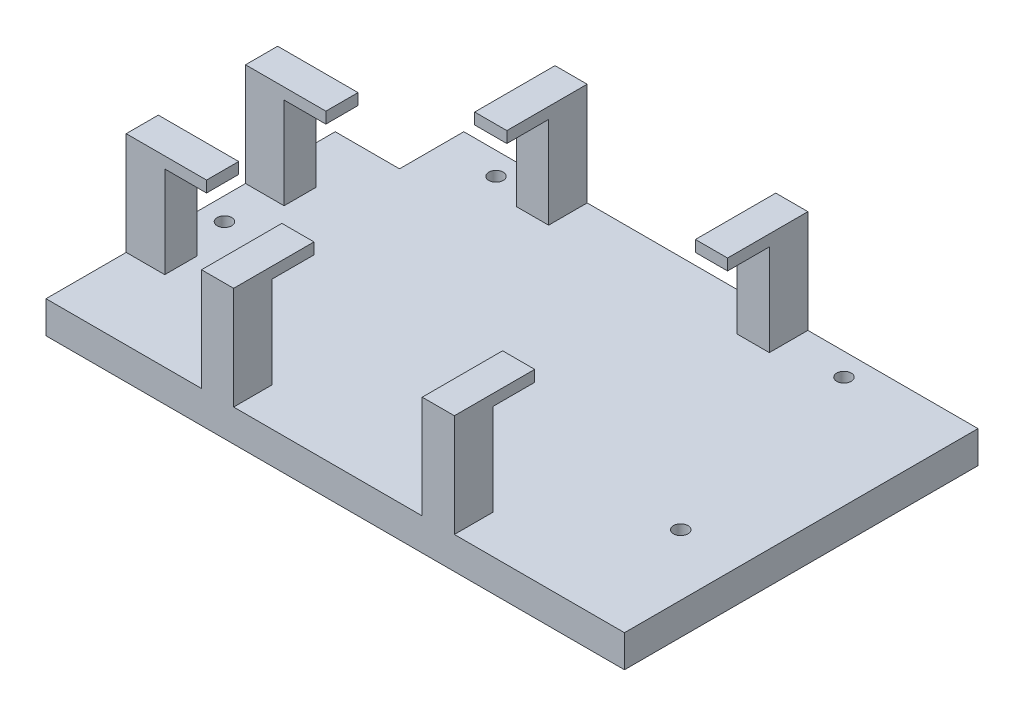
ISO-10303-21;
HEADER;
FILE_DESCRIPTION(('STEP AP214'),'2;1');
FILE_NAME('part.step','',(''),(''),'','','');
FILE_SCHEMA(('AUTOMOTIVE_DESIGN { 1 0 10303 214 1 1 1 1 }'));
ENDSEC;
DATA;
#1=APPLICATION_CONTEXT('core data for automotive mechanical design processes');
#2=APPLICATION_PROTOCOL_DEFINITION('international standard','automotive_design',2000,#1);
#3=PRODUCT_CONTEXT('',#1,'mechanical');
#4=PRODUCT('Part','Part','',(#3));
#5=PRODUCT_RELATED_PRODUCT_CATEGORY('part','',(#4));
#6=PRODUCT_DEFINITION_FORMATION('','',#4);
#7=PRODUCT_DEFINITION_CONTEXT('part definition',#1,'design');
#8=PRODUCT_DEFINITION('design','',#6,#7);
#9=PRODUCT_DEFINITION_SHAPE('','',#8);
#10=(LENGTH_UNIT() NAMED_UNIT(*) SI_UNIT(.MILLI.,.METRE.));
#11=(NAMED_UNIT(*) PLANE_ANGLE_UNIT() SI_UNIT($,.RADIAN.));
#12=(NAMED_UNIT(*) SI_UNIT($,.STERADIAN.) SOLID_ANGLE_UNIT());
#13=UNCERTAINTY_MEASURE_WITH_UNIT(LENGTH_MEASURE(1.E-05),#10,'distance_accuracy_value','');
#14=(GEOMETRIC_REPRESENTATION_CONTEXT(3) GLOBAL_UNCERTAINTY_ASSIGNED_CONTEXT((#13)) GLOBAL_UNIT_ASSIGNED_CONTEXT((#10,
#11,#12)) REPRESENTATION_CONTEXT('',''));
#15=CARTESIAN_POINT('',(0.,0.,0.));
#16=DIRECTION('',(0.,0.,1.));
#17=DIRECTION('',(1.,0.,0.));
#18=AXIS2_PLACEMENT_3D('',#15,#16,#17);
#19=CARTESIAN_POINT('',(0.,0.,0.));
#20=DIRECTION('',(0.,1.,0.));
#21=DIRECTION('',(0.,0.,1.));
#22=AXIS2_PLACEMENT_3D('',#19,#20,#21);
#23=PLANE('',#22);
#24=CARTESIAN_POINT('',(161.,0.,73.5));
#25=DIRECTION('',(0.,1.,0.));
#26=DIRECTION('',(0.,0.,1.));
#27=AXIS2_PLACEMENT_3D('',#24,#25,#26);
#28=CIRCLE('',#27,2.25000000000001);
#29=CARTESIAN_POINT('',(161.,0.,75.75));
#30=VERTEX_POINT('',#29);
#31=EDGE_CURVE('E641',#30,#30,#28,.T.);
#32=ORIENTED_EDGE('',*,*,#31,.F.);
#33=EDGE_LOOP('',(#32));
#34=FACE_BOUND('',#33,.T.);
#35=CARTESIAN_POINT('',(7.00000000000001,0.,61.4747149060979));
#36=DIRECTION('',(0.,1.,0.));
#37=DIRECTION('',(0.,0.,1.));
#38=AXIS2_PLACEMENT_3D('',#35,#36,#37);
#39=CIRCLE('',#38,2.24999999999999);
#40=CARTESIAN_POINT('',(7.00000000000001,0.,63.7247149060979));
#41=VERTEX_POINT('',#40);
#42=EDGE_CURVE('E635',#41,#41,#39,.T.);
#43=ORIENTED_EDGE('',*,*,#42,.F.);
#44=EDGE_LOOP('',(#43));
#45=FACE_BOUND('',#44,.T.);
#46=CARTESIAN_POINT('',(145.292136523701,0.,6.99999999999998));
#47=DIRECTION('',(0.,1.,0.));
#48=DIRECTION('',(0.,0.,1.));
#49=AXIS2_PLACEMENT_3D('',#46,#47,#48);
#50=CIRCLE('',#49,2.25000000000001);
#51=CARTESIAN_POINT('',(145.292136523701,0.,9.24999999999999));
#52=VERTEX_POINT('',#51);
#53=EDGE_CURVE('E617',#52,#52,#50,.T.);
#54=ORIENTED_EDGE('',*,*,#53,.F.);
#55=EDGE_LOOP('',(#54));
#56=FACE_BOUND('',#55,.T.);
#57=CARTESIAN_POINT('',(37.0246117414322,0.,6.99999999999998));
#58=DIRECTION('',(0.,1.,0.));
#59=DIRECTION('',(0.,0.,1.));
#60=AXIS2_PLACEMENT_3D('',#57,#58,#59);
#61=CIRCLE('',#60,2.25);
#62=CARTESIAN_POINT('',(37.0246117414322,0.,9.24999999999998));
#63=VERTEX_POINT('',#62);
#64=EDGE_CURVE('E625',#63,#63,#61,.T.);
#65=ORIENTED_EDGE('',*,*,#64,.F.);
#66=EDGE_LOOP('',(#65));
#67=FACE_BOUND('',#66,.T.);
#68=DIRECTION('',(1.,0.,0.));
#69=VECTOR('',#68,1.);
#70=CARTESIAN_POINT('',(0.,0.,110.));
#71=LINE('',#70,#69);
#72=CARTESIAN_POINT('',(58.3906525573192,0.,110.));
#73=VERTEX_POINT('',#72);
#74=CARTESIAN_POINT('',(117.070420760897,0.,110.));
#75=VERTEX_POINT('',#74);
#76=EDGE_CURVE('E672',#73,#75,#71,.T.);
#77=ORIENTED_EDGE('',*,*,#76,.T.);
#78=DIRECTION('',(0.,0.,1.));
#79=VECTOR('',#78,1.);
#80=CARTESIAN_POINT('',(117.070420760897,0.,110.));
#81=LINE('',#80,#79);
#82=CARTESIAN_POINT('',(117.070420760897,0.,98.));
#83=VERTEX_POINT('',#82);
#84=EDGE_CURVE('E61',#83,#75,#81,.T.);
#85=ORIENTED_EDGE('',*,*,#84,.F.);
#86=DIRECTION('',(-1.,0.,0.));
#87=VECTOR('',#86,1.);
#88=CARTESIAN_POINT('',(117.070420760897,0.,98.));
#89=LINE('',#88,#87);
#90=CARTESIAN_POINT('',(127.070420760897,0.,98.));
#91=VERTEX_POINT('',#90);
#92=EDGE_CURVE('E56',#91,#83,#89,.T.);
#93=ORIENTED_EDGE('',*,*,#92,.F.);
#94=DIRECTION('',(0.,0.,-1.));
#95=VECTOR('',#94,1.);
#96=CARTESIAN_POINT('',(127.070420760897,0.,110.));
#97=LINE('',#96,#95);
#98=CARTESIAN_POINT('',(127.070420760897,0.,110.));
#99=VERTEX_POINT('',#98);
#100=EDGE_CURVE('E496',#99,#91,#97,.T.);
#101=ORIENTED_EDGE('',*,*,#100,.F.);
#102=CARTESIAN_POINT('',(180.,0.,110.));
#103=VERTEX_POINT('',#102);
#104=EDGE_CURVE('E667',#99,#103,#71,.T.);
#105=ORIENTED_EDGE('',*,*,#104,.T.);
#106=DIRECTION('',(0.,0.,1.));
#107=VECTOR('',#106,1.);
#108=CARTESIAN_POINT('',(180.,0.,0.));
#109=LINE('',#108,#107);
#110=CARTESIAN_POINT('',(180.,0.,0.));
#111=VERTEX_POINT('',#110);
#112=EDGE_CURVE('E671',#111,#103,#109,.T.);
#113=ORIENTED_EDGE('',*,*,#112,.F.);
#114=DIRECTION('',(-1.,0.,0.));
#115=VECTOR('',#114,1.);
#116=CARTESIAN_POINT('',(0.,0.,0.));
#117=LINE('',#116,#115);
#118=CARTESIAN_POINT('',(127.070420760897,0.,0.));
#119=VERTEX_POINT('',#118);
#120=EDGE_CURVE('E656',#111,#119,#117,.T.);
#121=ORIENTED_EDGE('',*,*,#120,.T.);
#122=DIRECTION('',(0.,0.,-1.));
#123=VECTOR('',#122,1.);
#124=CARTESIAN_POINT('',(127.070420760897,0.,0.));
#125=LINE('',#124,#123);
#126=CARTESIAN_POINT('',(127.070420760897,0.,12.));
#127=VERTEX_POINT('',#126);
#128=EDGE_CURVE('E538',#127,#119,#125,.T.);
#129=ORIENTED_EDGE('',*,*,#128,.F.);
#130=DIRECTION('',(1.,0.,0.));
#131=VECTOR('',#130,1.);
#132=CARTESIAN_POINT('',(117.070420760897,0.,12.));
#133=LINE('',#132,#131);
#134=CARTESIAN_POINT('',(117.070420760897,0.,12.));
#135=VERTEX_POINT('',#134);
#136=EDGE_CURVE('E541',#135,#127,#133,.T.);
#137=ORIENTED_EDGE('',*,*,#136,.F.);
#138=DIRECTION('',(0.,0.,1.));
#139=VECTOR('',#138,1.);
#140=CARTESIAN_POINT('',(117.070420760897,0.,0.));
#141=LINE('',#140,#139);
#142=CARTESIAN_POINT('',(117.070420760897,0.,0.));
#143=VERTEX_POINT('',#142);
#144=EDGE_CURVE('E544',#143,#135,#141,.T.);
#145=ORIENTED_EDGE('',*,*,#144,.F.);
#146=CARTESIAN_POINT('',(58.3906525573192,0.,0.));
#147=VERTEX_POINT('',#146);
#148=EDGE_CURVE('E676',#143,#147,#117,.T.);
#149=ORIENTED_EDGE('',*,*,#148,.T.);
#150=DIRECTION('',(0.,0.,-1.));
#151=VECTOR('',#150,1.);
#152=CARTESIAN_POINT('',(58.3906525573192,0.,0.));
#153=LINE('',#152,#151);
#154=CARTESIAN_POINT('',(58.3906525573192,0.,12.));
#155=VERTEX_POINT('',#154);
#156=EDGE_CURVE('E315',#155,#147,#153,.T.);
#157=ORIENTED_EDGE('',*,*,#156,.F.);
#158=DIRECTION('',(1.,0.,0.));
#159=VECTOR('',#158,1.);
#160=CARTESIAN_POINT('',(48.3906525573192,0.,12.));
#161=LINE('',#160,#159);
#162=CARTESIAN_POINT('',(48.3906525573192,0.,12.));
#163=VERTEX_POINT('',#162);
#164=EDGE_CURVE('E556',#163,#155,#161,.T.);
#165=ORIENTED_EDGE('',*,*,#164,.F.);
#166=DIRECTION('',(0.,0.,1.));
#167=VECTOR('',#166,1.);
#168=CARTESIAN_POINT('',(48.3906525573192,0.,0.));
#169=LINE('',#168,#167);
#170=CARTESIAN_POINT('',(48.3906525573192,0.,0.));
#171=VERTEX_POINT('',#170);
#172=EDGE_CURVE('E559',#171,#163,#169,.T.);
#173=ORIENTED_EDGE('',*,*,#172,.F.);
#174=CARTESIAN_POINT('',(20.,0.,0.));
#175=VERTEX_POINT('',#174);
#176=EDGE_CURVE('E675',#171,#175,#117,.T.);
#177=ORIENTED_EDGE('',*,*,#176,.T.);
#178=DIRECTION('',(0.,0.,-1.));
#179=VECTOR('',#178,1.);
#180=CARTESIAN_POINT('',(20.,0.,0.));
#181=LINE('',#180,#179);
#182=CARTESIAN_POINT('',(20.,0.,20.));
#183=VERTEX_POINT('',#182);
#184=EDGE_CURVE('E618',#183,#175,#181,.T.);
#185=ORIENTED_EDGE('',*,*,#184,.F.);
#186=DIRECTION('',(1.,0.,0.));
#187=VECTOR('',#186,1.);
#188=CARTESIAN_POINT('',(0.,0.,20.));
#189=LINE('',#188,#187);
#190=CARTESIAN_POINT('',(0.,0.,20.));
#191=VERTEX_POINT('',#190);
#192=EDGE_CURVE('E621',#191,#183,#189,.T.);
#193=ORIENTED_EDGE('',*,*,#192,.F.);
#194=DIRECTION('',(0.,0.,-1.));
#195=VECTOR('',#194,1.);
#196=CARTESIAN_POINT('',(0.,0.,0.));
#197=LINE('',#196,#195);
#198=CARTESIAN_POINT('',(0.,0.,37.9161136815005));
#199=VERTEX_POINT('',#198);
#200=EDGE_CURVE('E649',#199,#191,#197,.T.);
#201=ORIENTED_EDGE('',*,*,#200,.F.);
#202=DIRECTION('',(-1.,0.,0.));
#203=VECTOR('',#202,1.);
#204=CARTESIAN_POINT('',(0.,0.,37.9161136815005));
#205=LINE('',#204,#203);
#206=CARTESIAN_POINT('',(12.,0.,37.9161136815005));
#207=VERTEX_POINT('',#206);
#208=EDGE_CURVE('E589',#207,#199,#205,.T.);
#209=ORIENTED_EDGE('',*,*,#208,.F.);
#210=DIRECTION('',(0.,0.,-1.));
#211=VECTOR('',#210,1.);
#212=CARTESIAN_POINT('',(12.,0.,37.9161136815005));
#213=LINE('',#212,#211);
#214=CARTESIAN_POINT('',(12.,0.,47.9161136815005));
#215=VERTEX_POINT('',#214);
#216=EDGE_CURVE('E592',#215,#207,#213,.T.);
#217=ORIENTED_EDGE('',*,*,#216,.F.);
#218=DIRECTION('',(1.,0.,0.));
#219=VECTOR('',#218,1.);
#220=CARTESIAN_POINT('',(0.,0.,47.9161136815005));
#221=LINE('',#220,#219);
#222=CARTESIAN_POINT('',(0.,0.,47.9161136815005));
#223=VERTEX_POINT('',#222);
#224=EDGE_CURVE('E582',#223,#215,#221,.T.);
#225=ORIENTED_EDGE('',*,*,#224,.F.);
#226=CARTESIAN_POINT('',(0.,0.,75.0482136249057));
#227=VERTEX_POINT('',#226);
#228=EDGE_CURVE('E668',#227,#223,#197,.T.);
#229=ORIENTED_EDGE('',*,*,#228,.F.);
#230=DIRECTION('',(-1.,0.,0.));
#231=VECTOR('',#230,1.);
#232=CARTESIAN_POINT('',(0.,0.,75.0482136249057));
#233=LINE('',#232,#231);
#234=CARTESIAN_POINT('',(12.,0.,75.0482136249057));
#235=VERTEX_POINT('',#234);
#236=EDGE_CURVE('E575',#235,#227,#233,.T.);
#237=ORIENTED_EDGE('',*,*,#236,.F.);
#238=DIRECTION('',(0.,0.,-1.));
#239=VECTOR('',#238,1.);
#240=CARTESIAN_POINT('',(12.,0.,75.0482136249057));
#241=LINE('',#240,#239);
#242=CARTESIAN_POINT('',(12.,0.,85.0482136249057));
#243=VERTEX_POINT('',#242);
#244=EDGE_CURVE('E577',#243,#235,#241,.T.);
#245=ORIENTED_EDGE('',*,*,#244,.F.);
#246=DIRECTION('',(1.,0.,0.));
#247=VECTOR('',#246,1.);
#248=CARTESIAN_POINT('',(0.,0.,85.0482136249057));
#249=LINE('',#248,#247);
#250=CARTESIAN_POINT('',(0.,0.,85.0482136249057));
#251=VERTEX_POINT('',#250);
#252=EDGE_CURVE('E580',#251,#243,#249,.T.);
#253=ORIENTED_EDGE('',*,*,#252,.F.);
#254=CARTESIAN_POINT('',(0.,0.,110.));
#255=VERTEX_POINT('',#254);
#256=EDGE_CURVE('E664',#255,#251,#197,.T.);
#257=ORIENTED_EDGE('',*,*,#256,.F.);
#258=CARTESIAN_POINT('',(48.3906525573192,0.,110.));
#259=VERTEX_POINT('',#258);
#260=EDGE_CURVE('E669',#255,#259,#71,.T.);
#261=ORIENTED_EDGE('',*,*,#260,.T.);
#262=DIRECTION('',(0.,0.,1.));
#263=VECTOR('',#262,1.);
#264=CARTESIAN_POINT('',(48.3906525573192,0.,110.));
#265=LINE('',#264,#263);
#266=CARTESIAN_POINT('',(48.3906525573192,0.,98.));
#267=VERTEX_POINT('',#266);
#268=EDGE_CURVE('E520',#267,#259,#265,.T.);
#269=ORIENTED_EDGE('',*,*,#268,.F.);
#270=DIRECTION('',(-1.,0.,0.));
#271=VECTOR('',#270,1.);
#272=CARTESIAN_POINT('',(48.3906525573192,0.,98.));
#273=LINE('',#272,#271);
#274=CARTESIAN_POINT('',(58.3906525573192,0.,98.));
#275=VERTEX_POINT('',#274);
#276=EDGE_CURVE('E514',#275,#267,#273,.T.);
#277=ORIENTED_EDGE('',*,*,#276,.F.);
#278=DIRECTION('',(0.,0.,-1.));
#279=VECTOR('',#278,1.);
#280=CARTESIAN_POINT('',(58.3906525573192,0.,110.));
#281=LINE('',#280,#279);
#282=EDGE_CURVE('E517',#73,#275,#281,.T.);
#283=ORIENTED_EDGE('',*,*,#282,.F.);
#284=EDGE_LOOP('',(#77,#85,#93,#101,#105,#113,#121,#129,#137,#145,#149,#157,#165,#173,#177,#185,
#193,#201,#209,#217,#225,#229,#237,#245,#253,#257,#261,#269,#277,#283));
#285=FACE_BOUND('',#284,.T.);
#286=ADVANCED_FACE('F39',(#34,#45,#56,#67,#285),#23,.T.);
#287=CARTESIAN_POINT('',(0.,-10.,0.));
#288=DIRECTION('',(1.,0.,0.));
#289=DIRECTION('',(0.,0.,-1.));
#290=AXIS2_PLACEMENT_3D('',#287,#288,#289);
#291=PLANE('',#290);
#292=ORIENTED_EDGE('',*,*,#256,.T.);
#293=DIRECTION('',(0.,-1.,0.));
#294=VECTOR('',#293,1.);
#295=CARTESIAN_POINT('',(0.,28.5,85.0482136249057));
#296=LINE('',#295,#294);
#297=CARTESIAN_POINT('',(0.,32.,85.0482136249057));
#298=VERTEX_POINT('',#297);
#299=EDGE_CURVE('E562',#298,#251,#296,.T.);
#300=ORIENTED_EDGE('',*,*,#299,.F.);
#301=DIRECTION('',(0.,0.,-1.));
#302=VECTOR('',#301,1.);
#303=CARTESIAN_POINT('',(0.,32.,75.0482136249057));
#304=LINE('',#303,#302);
#305=CARTESIAN_POINT('',(0.,32.,75.0482136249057));
#306=VERTEX_POINT('',#305);
#307=EDGE_CURVE('E441',#298,#306,#304,.T.);
#308=ORIENTED_EDGE('',*,*,#307,.T.);
#309=DIRECTION('',(0.,-1.,0.));
#310=VECTOR('',#309,1.);
#311=CARTESIAN_POINT('',(0.,28.5,75.0482136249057));
#312=LINE('',#311,#310);
#313=EDGE_CURVE('E571',#306,#227,#312,.T.);
#314=ORIENTED_EDGE('',*,*,#313,.T.);
#315=ORIENTED_EDGE('',*,*,#228,.T.);
#316=DIRECTION('',(0.,-1.,0.));
#317=VECTOR('',#316,1.);
#318=CARTESIAN_POINT('',(0.,28.5,47.9161136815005));
#319=LINE('',#318,#317);
#320=CARTESIAN_POINT('',(0.,32.,47.9161136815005));
#321=VERTEX_POINT('',#320);
#322=EDGE_CURVE('E605',#321,#223,#319,.T.);
#323=ORIENTED_EDGE('',*,*,#322,.F.);
#324=DIRECTION('',(0.,0.,-1.));
#325=VECTOR('',#324,1.);
#326=CARTESIAN_POINT('',(0.,32.,37.9161136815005));
#327=LINE('',#326,#325);
#328=CARTESIAN_POINT('',(0.,32.,37.9161136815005));
#329=VERTEX_POINT('',#328);
#330=EDGE_CURVE('E444',#321,#329,#327,.T.);
#331=ORIENTED_EDGE('',*,*,#330,.T.);
#332=DIRECTION('',(0.,-1.,0.));
#333=VECTOR('',#332,1.);
#334=CARTESIAN_POINT('',(0.,28.5,37.9161136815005));
#335=LINE('',#334,#333);
#336=EDGE_CURVE('E588',#329,#199,#335,.T.);
#337=ORIENTED_EDGE('',*,*,#336,.T.);
#338=ORIENTED_EDGE('',*,*,#200,.T.);
#339=DIRECTION('',(0.,1.,0.));
#340=VECTOR('',#339,1.);
#341=CARTESIAN_POINT('',(0.,-10.,20.));
#342=LINE('',#341,#340);
#343=CARTESIAN_POINT('',(0.,-10.,20.));
#344=VERTEX_POINT('',#343);
#345=EDGE_CURVE('E609',#344,#191,#342,.T.);
#346=ORIENTED_EDGE('',*,*,#345,.F.);
#347=DIRECTION('',(0.,0.,-1.));
#348=VECTOR('',#347,1.);
#349=CARTESIAN_POINT('',(0.,-10.,0.));
#350=LINE('',#349,#348);
#351=CARTESIAN_POINT('',(0.,-10.,110.));
#352=VERTEX_POINT('',#351);
#353=EDGE_CURVE('E652',#352,#344,#350,.T.);
#354=ORIENTED_EDGE('',*,*,#353,.F.);
#355=DIRECTION('',(0.,1.,0.));
#356=VECTOR('',#355,1.);
#357=CARTESIAN_POINT('',(0.,-10.,110.));
#358=LINE('',#357,#356);
#359=EDGE_CURVE('E43',#352,#255,#358,.T.);
#360=ORIENTED_EDGE('',*,*,#359,.T.);
#361=EDGE_LOOP('',(#292,#300,#308,#314,#315,#323,#331,#337,#338,#346,#354,#360));
#362=FACE_BOUND('',#361,.T.);
#363=ADVANCED_FACE('F41',(#362),#291,.F.);
#364=CARTESIAN_POINT('',(0.,-10.,0.));
#365=DIRECTION('',(0.,0.,-1.));
#366=DIRECTION('',(-1.,0.,0.));
#367=AXIS2_PLACEMENT_3D('',#364,#365,#366);
#368=PLANE('',#367);
#369=DIRECTION('',(0.,1.,0.));
#370=VECTOR('',#369,1.);
#371=CARTESIAN_POINT('',(20.,-10.,0.));
#372=LINE('',#371,#370);
#373=CARTESIAN_POINT('',(20.,-10.,0.));
#374=VERTEX_POINT('',#373);
#375=EDGE_CURVE('E615',#374,#175,#372,.T.);
#376=ORIENTED_EDGE('',*,*,#375,.T.);
#377=ORIENTED_EDGE('',*,*,#176,.F.);
#378=DIRECTION('',(0.,-1.,0.));
#379=VECTOR('',#378,1.);
#380=CARTESIAN_POINT('',(48.3906525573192,28.5,0.));
#381=LINE('',#380,#379);
#382=CARTESIAN_POINT('',(48.3906525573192,32.,0.));
#383=VERTEX_POINT('',#382);
#384=EDGE_CURVE('E318',#383,#171,#381,.T.);
#385=ORIENTED_EDGE('',*,*,#384,.F.);
#386=DIRECTION('',(1.,0.,0.));
#387=VECTOR('',#386,1.);
#388=CARTESIAN_POINT('',(58.3906525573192,32.,0.));
#389=LINE('',#388,#387);
#390=CARTESIAN_POINT('',(58.3906525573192,32.,0.));
#391=VERTEX_POINT('',#390);
#392=EDGE_CURVE('E325',#383,#391,#389,.T.);
#393=ORIENTED_EDGE('',*,*,#392,.T.);
#394=DIRECTION('',(0.,-1.,0.));
#395=VECTOR('',#394,1.);
#396=CARTESIAN_POINT('',(58.3906525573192,28.5,0.));
#397=LINE('',#396,#395);
#398=EDGE_CURVE('E308',#391,#147,#397,.T.);
#399=ORIENTED_EDGE('',*,*,#398,.T.);
#400=ORIENTED_EDGE('',*,*,#148,.F.);
#401=DIRECTION('',(0.,-1.,0.));
#402=VECTOR('',#401,1.);
#403=CARTESIAN_POINT('',(117.070420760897,28.5,0.));
#404=LINE('',#403,#402);
#405=CARTESIAN_POINT('',(117.070420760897,32.,0.));
#406=VERTEX_POINT('',#405);
#407=EDGE_CURVE('E534',#406,#143,#404,.T.);
#408=ORIENTED_EDGE('',*,*,#407,.F.);
#409=DIRECTION('',(1.,0.,0.));
#410=VECTOR('',#409,1.);
#411=CARTESIAN_POINT('',(127.070420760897,32.,0.));
#412=LINE('',#411,#410);
#413=CARTESIAN_POINT('',(127.070420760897,32.,0.));
#414=VERTEX_POINT('',#413);
#415=EDGE_CURVE('E334',#406,#414,#412,.T.);
#416=ORIENTED_EDGE('',*,*,#415,.T.);
#417=DIRECTION('',(0.,-1.,0.));
#418=VECTOR('',#417,1.);
#419=CARTESIAN_POINT('',(127.070420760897,28.5,0.));
#420=LINE('',#419,#418);
#421=EDGE_CURVE('E531',#414,#119,#420,.T.);
#422=ORIENTED_EDGE('',*,*,#421,.T.);
#423=ORIENTED_EDGE('',*,*,#120,.F.);
#424=DIRECTION('',(0.,1.,0.));
#425=VECTOR('',#424,1.);
#426=CARTESIAN_POINT('',(180.,-10.,0.));
#427=LINE('',#426,#425);
#428=CARTESIAN_POINT('',(180.,-10.,0.));
#429=VERTEX_POINT('',#428);
#430=EDGE_CURVE('E11',#429,#111,#427,.T.);
#431=ORIENTED_EDGE('',*,*,#430,.F.);
#432=DIRECTION('',(-1.,0.,0.));
#433=VECTOR('',#432,1.);
#434=CARTESIAN_POINT('',(0.,-10.,0.));
#435=LINE('',#434,#433);
#436=EDGE_CURVE('E661',#429,#374,#435,.T.);
#437=ORIENTED_EDGE('',*,*,#436,.T.);
#438=EDGE_LOOP('',(#376,#377,#385,#393,#399,#400,#408,#416,#422,#423,#431,#437));
#439=FACE_BOUND('',#438,.T.);
#440=ADVANCED_FACE('F331',(#439),#368,.T.);
#441=CARTESIAN_POINT('',(180.,-10.,0.));
#442=DIRECTION('',(-1.,0.,0.));
#443=DIRECTION('',(0.,0.,1.));
#444=AXIS2_PLACEMENT_3D('',#441,#442,#443);
#445=PLANE('',#444);
#446=ORIENTED_EDGE('',*,*,#112,.T.);
#447=DIRECTION('',(0.,1.,0.));
#448=VECTOR('',#447,1.);
#449=CARTESIAN_POINT('',(180.,-10.,110.));
#450=LINE('',#449,#448);
#451=CARTESIAN_POINT('',(180.,-10.,110.));
#452=VERTEX_POINT('',#451);
#453=EDGE_CURVE('E48',#452,#103,#450,.T.);
#454=ORIENTED_EDGE('',*,*,#453,.F.);
#455=DIRECTION('',(0.,0.,1.));
#456=VECTOR('',#455,1.);
#457=CARTESIAN_POINT('',(180.,-10.,0.));
#458=LINE('',#457,#456);
#459=EDGE_CURVE('E659',#429,#452,#458,.T.);
#460=ORIENTED_EDGE('',*,*,#459,.F.);
#461=ORIENTED_EDGE('',*,*,#430,.T.);
#462=EDGE_LOOP('',(#446,#454,#460,#461));
#463=FACE_BOUND('',#462,.T.);
#464=ADVANCED_FACE('F795',(#463),#445,.F.);
#465=CARTESIAN_POINT('',(0.,-10.,110.));
#466=DIRECTION('',(0.,0.,1.));
#467=DIRECTION('',(1.,0.,0.));
#468=AXIS2_PLACEMENT_3D('',#465,#466,#467);
#469=PLANE('',#468);
#470=ORIENTED_EDGE('',*,*,#260,.F.);
#471=ORIENTED_EDGE('',*,*,#359,.F.);
#472=DIRECTION('',(1.,0.,0.));
#473=VECTOR('',#472,1.);
#474=CARTESIAN_POINT('',(0.,-10.,110.));
#475=LINE('',#474,#473);
#476=EDGE_CURVE('E655',#352,#452,#475,.T.);
#477=ORIENTED_EDGE('',*,*,#476,.T.);
#478=ORIENTED_EDGE('',*,*,#453,.T.);
#479=ORIENTED_EDGE('',*,*,#104,.F.);
#480=DIRECTION('',(0.,-1.,0.));
#481=VECTOR('',#480,1.);
#482=CARTESIAN_POINT('',(127.070420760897,28.5,110.));
#483=LINE('',#482,#481);
#484=CARTESIAN_POINT('',(127.070420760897,32.,110.));
#485=VERTEX_POINT('',#484);
#486=EDGE_CURVE('E485',#485,#99,#483,.T.);
#487=ORIENTED_EDGE('',*,*,#486,.F.);
#488=DIRECTION('',(-1.,0.,0.));
#489=VECTOR('',#488,1.);
#490=CARTESIAN_POINT('',(117.070420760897,32.,110.));
#491=LINE('',#490,#489);
#492=CARTESIAN_POINT('',(117.070420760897,32.,110.));
#493=VERTEX_POINT('',#492);
#494=EDGE_CURVE('E387',#485,#493,#491,.T.);
#495=ORIENTED_EDGE('',*,*,#494,.T.);
#496=DIRECTION('',(0.,-1.,0.));
#497=VECTOR('',#496,1.);
#498=CARTESIAN_POINT('',(117.070420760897,28.5,110.));
#499=LINE('',#498,#497);
#500=EDGE_CURVE('E474',#493,#75,#499,.T.);
#501=ORIENTED_EDGE('',*,*,#500,.T.);
#502=ORIENTED_EDGE('',*,*,#76,.F.);
#503=DIRECTION('',(0.,-1.,0.));
#504=VECTOR('',#503,1.);
#505=CARTESIAN_POINT('',(58.3906525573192,28.5,110.));
#506=LINE('',#505,#504);
#507=CARTESIAN_POINT('',(58.3906525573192,32.,110.));
#508=VERTEX_POINT('',#507);
#509=EDGE_CURVE('E504',#508,#73,#506,.T.);
#510=ORIENTED_EDGE('',*,*,#509,.F.);
#511=DIRECTION('',(-1.,0.,0.));
#512=VECTOR('',#511,1.);
#513=CARTESIAN_POINT('',(48.3906525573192,32.,110.));
#514=LINE('',#513,#512);
#515=CARTESIAN_POINT('',(48.3906525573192,32.,110.));
#516=VERTEX_POINT('',#515);
#517=EDGE_CURVE('E390',#508,#516,#514,.T.);
#518=ORIENTED_EDGE('',*,*,#517,.T.);
#519=DIRECTION('',(0.,-1.,0.));
#520=VECTOR('',#519,1.);
#521=CARTESIAN_POINT('',(48.3906525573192,28.5,110.));
#522=LINE('',#521,#520);
#523=EDGE_CURVE('E499',#516,#259,#522,.T.);
#524=ORIENTED_EDGE('',*,*,#523,.T.);
#525=EDGE_LOOP('',(#470,#471,#477,#478,#479,#487,#495,#501,#502,#510,#518,#524));
#526=FACE_BOUND('',#525,.T.);
#527=ADVANCED_FACE('F688',(#526),#469,.T.);
#528=CARTESIAN_POINT('',(0.,-10.,0.));
#529=DIRECTION('',(0.,1.,0.));
#530=DIRECTION('',(0.,0.,1.));
#531=AXIS2_PLACEMENT_3D('',#528,#529,#530);
#532=PLANE('',#531);
#533=CARTESIAN_POINT('',(161.,-10.,73.5));
#534=DIRECTION('',(0.,1.,0.));
#535=DIRECTION('',(0.,0.,1.));
#536=AXIS2_PLACEMENT_3D('',#533,#534,#535);
#537=CIRCLE('',#536,2.25000000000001);
#538=CARTESIAN_POINT('',(161.,-10.,75.75));
#539=VERTEX_POINT('',#538);
#540=EDGE_CURVE('E608',#539,#539,#537,.T.);
#541=ORIENTED_EDGE('',*,*,#540,.T.);
#542=EDGE_LOOP('',(#541));
#543=FACE_BOUND('',#542,.T.);
#544=CARTESIAN_POINT('',(7.00000000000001,-10.,61.4747149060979));
#545=DIRECTION('',(0.,1.,0.));
#546=DIRECTION('',(0.,0.,1.));
#547=AXIS2_PLACEMENT_3D('',#544,#545,#546);
#548=CIRCLE('',#547,2.24999999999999);
#549=CARTESIAN_POINT('',(7.00000000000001,-10.,63.7247149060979));
#550=VERTEX_POINT('',#549);
#551=EDGE_CURVE('E638',#550,#550,#548,.T.);
#552=ORIENTED_EDGE('',*,*,#551,.T.);
#553=EDGE_LOOP('',(#552));
#554=FACE_BOUND('',#553,.T.);
#555=CARTESIAN_POINT('',(145.292136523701,-10.,6.99999999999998));
#556=DIRECTION('',(0.,1.,0.));
#557=DIRECTION('',(0.,0.,1.));
#558=AXIS2_PLACEMENT_3D('',#555,#556,#557);
#559=CIRCLE('',#558,2.25000000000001);
#560=CARTESIAN_POINT('',(145.292136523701,-10.,9.24999999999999));
#561=VERTEX_POINT('',#560);
#562=EDGE_CURVE('E632',#561,#561,#559,.T.);
#563=ORIENTED_EDGE('',*,*,#562,.T.);
#564=EDGE_LOOP('',(#563));
#565=FACE_BOUND('',#564,.T.);
#566=CARTESIAN_POINT('',(37.0246117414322,-10.,6.99999999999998));
#567=DIRECTION('',(0.,1.,0.));
#568=DIRECTION('',(0.,0.,1.));
#569=AXIS2_PLACEMENT_3D('',#566,#567,#568);
#570=CIRCLE('',#569,2.25);
#571=CARTESIAN_POINT('',(37.0246117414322,-10.,9.24999999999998));
#572=VERTEX_POINT('',#571);
#573=EDGE_CURVE('E646',#572,#572,#570,.T.);
#574=ORIENTED_EDGE('',*,*,#573,.T.);
#575=EDGE_LOOP('',(#574));
#576=FACE_BOUND('',#575,.T.);
#577=DIRECTION('',(1.,0.,0.));
#578=VECTOR('',#577,1.);
#579=CARTESIAN_POINT('',(0.,-10.,20.));
#580=LINE('',#579,#578);
#581=CARTESIAN_POINT('',(20.,-10.,20.));
#582=VERTEX_POINT('',#581);
#583=EDGE_CURVE('E622',#344,#582,#580,.T.);
#584=ORIENTED_EDGE('',*,*,#583,.T.);
#585=DIRECTION('',(0.,0.,-1.));
#586=VECTOR('',#585,1.);
#587=CARTESIAN_POINT('',(20.,-10.,0.));
#588=LINE('',#587,#586);
#589=EDGE_CURVE('E612',#582,#374,#588,.T.);
#590=ORIENTED_EDGE('',*,*,#589,.T.);
#591=ORIENTED_EDGE('',*,*,#436,.F.);
#592=ORIENTED_EDGE('',*,*,#459,.T.);
#593=ORIENTED_EDGE('',*,*,#476,.F.);
#594=ORIENTED_EDGE('',*,*,#353,.T.);
#595=EDGE_LOOP('',(#584,#590,#591,#592,#593,#594));
#596=FACE_BOUND('',#595,.T.);
#597=ADVANCED_FACE('F748',(#543,#554,#565,#576,#596),#532,.F.);
#598=CARTESIAN_POINT('',(37.0246117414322,-10.,6.99999999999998));
#599=DIRECTION('',(0.,1.,0.));
#600=DIRECTION('',(0.,0.,1.));
#601=AXIS2_PLACEMENT_3D('',#598,#599,#600);
#602=CYLINDRICAL_SURFACE('',#601,2.25);
#603=ORIENTED_EDGE('',*,*,#573,.F.);
#604=EDGE_LOOP('',(#603));
#605=FACE_BOUND('',#604,.T.);
#606=ORIENTED_EDGE('',*,*,#64,.T.);
#607=EDGE_LOOP('',(#606));
#608=FACE_BOUND('',#607,.T.);
#609=ADVANCED_FACE('F801',(#605,#608),#602,.F.);
#610=CARTESIAN_POINT('',(20.,-10.,0.));
#611=DIRECTION('',(1.,0.,0.));
#612=DIRECTION('',(0.,0.,-1.));
#613=AXIS2_PLACEMENT_3D('',#610,#611,#612);
#614=PLANE('',#613);
#615=ORIENTED_EDGE('',*,*,#184,.T.);
#616=ORIENTED_EDGE('',*,*,#375,.F.);
#617=ORIENTED_EDGE('',*,*,#589,.F.);
#618=DIRECTION('',(0.,1.,0.));
#619=VECTOR('',#618,1.);
#620=CARTESIAN_POINT('',(20.,-10.,20.));
#621=LINE('',#620,#619);
#622=EDGE_CURVE('E613',#582,#183,#621,.T.);
#623=ORIENTED_EDGE('',*,*,#622,.T.);
#624=EDGE_LOOP('',(#615,#616,#617,#623));
#625=FACE_BOUND('',#624,.T.);
#626=ADVANCED_FACE('F744',(#625),#614,.F.);
#627=CARTESIAN_POINT('',(0.,-10.,20.));
#628=DIRECTION('',(0.,0.,1.));
#629=DIRECTION('',(1.,0.,0.));
#630=AXIS2_PLACEMENT_3D('',#627,#628,#629);
#631=PLANE('',#630);
#632=ORIENTED_EDGE('',*,*,#192,.T.);
#633=ORIENTED_EDGE('',*,*,#622,.F.);
#634=ORIENTED_EDGE('',*,*,#583,.F.);
#635=ORIENTED_EDGE('',*,*,#345,.T.);
#636=EDGE_LOOP('',(#632,#633,#634,#635));
#637=FACE_BOUND('',#636,.T.);
#638=ADVANCED_FACE('F750',(#637),#631,.F.);
#639=CARTESIAN_POINT('',(145.292136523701,-10.,6.99999999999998));
#640=DIRECTION('',(0.,1.,0.));
#641=DIRECTION('',(0.,0.,1.));
#642=AXIS2_PLACEMENT_3D('',#639,#640,#641);
#643=CYLINDRICAL_SURFACE('',#642,2.25000000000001);
#644=ORIENTED_EDGE('',*,*,#562,.F.);
#645=EDGE_LOOP('',(#644));
#646=FACE_BOUND('',#645,.T.);
#647=ORIENTED_EDGE('',*,*,#53,.T.);
#648=EDGE_LOOP('',(#647));
#649=FACE_BOUND('',#648,.T.);
#650=ADVANCED_FACE('F818',(#646,#649),#643,.F.);
#651=CARTESIAN_POINT('',(7.00000000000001,-10.,61.4747149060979));
#652=DIRECTION('',(0.,1.,0.));
#653=DIRECTION('',(0.,0.,1.));
#654=AXIS2_PLACEMENT_3D('',#651,#652,#653);
#655=CYLINDRICAL_SURFACE('',#654,2.24999999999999);
#656=ORIENTED_EDGE('',*,*,#551,.F.);
#657=EDGE_LOOP('',(#656));
#658=FACE_BOUND('',#657,.T.);
#659=ORIENTED_EDGE('',*,*,#42,.T.);
#660=EDGE_LOOP('',(#659));
#661=FACE_BOUND('',#660,.T.);
#662=ADVANCED_FACE('F821',(#658,#661),#655,.F.);
#663=CARTESIAN_POINT('',(161.,-10.,73.5));
#664=DIRECTION('',(0.,1.,0.));
#665=DIRECTION('',(0.,0.,1.));
#666=AXIS2_PLACEMENT_3D('',#663,#664,#665);
#667=CYLINDRICAL_SURFACE('',#666,2.25000000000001);
#668=ORIENTED_EDGE('',*,*,#540,.F.);
#669=EDGE_LOOP('',(#668));
#670=FACE_BOUND('',#669,.T.);
#671=ORIENTED_EDGE('',*,*,#31,.T.);
#672=EDGE_LOOP('',(#671));
#673=FACE_BOUND('',#672,.T.);
#674=ADVANCED_FACE('F780',(#670,#673),#667,.F.);
#675=CARTESIAN_POINT('',(0.,28.5,47.9161136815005));
#676=DIRECTION('',(0.,0.,-1.));
#677=DIRECTION('',(-1.,0.,0.));
#678=AXIS2_PLACEMENT_3D('',#675,#676,#677);
#679=PLANE('',#678);
#680=ORIENTED_EDGE('',*,*,#224,.T.);
#681=DIRECTION('',(0.,-1.,0.));
#682=VECTOR('',#681,1.);
#683=CARTESIAN_POINT('',(12.,28.5,47.9161136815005));
#684=LINE('',#683,#682);
#685=CARTESIAN_POINT('',(12.,28.5,47.9161136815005));
#686=VERTEX_POINT('',#685);
#687=EDGE_CURVE('E602',#686,#215,#684,.T.);
#688=ORIENTED_EDGE('',*,*,#687,.F.);
#689=DIRECTION('',(-1.,0.,0.));
#690=VECTOR('',#689,1.);
#691=CARTESIAN_POINT('',(25.,28.5,47.9161136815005));
#692=LINE('',#691,#690);
#693=CARTESIAN_POINT('',(25.,28.5,47.9161136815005));
#694=VERTEX_POINT('',#693);
#695=EDGE_CURVE('E478',#694,#686,#692,.T.);
#696=ORIENTED_EDGE('',*,*,#695,.F.);
#697=DIRECTION('',(0.,1.,0.));
#698=VECTOR('',#697,1.);
#699=CARTESIAN_POINT('',(25.,28.5,47.9161136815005));
#700=LINE('',#699,#698);
#701=CARTESIAN_POINT('',(25.,32.,47.9161136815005));
#702=VERTEX_POINT('',#701);
#703=EDGE_CURVE('E462',#694,#702,#700,.T.);
#704=ORIENTED_EDGE('',*,*,#703,.T.);
#705=DIRECTION('',(-1.,0.,0.));
#706=VECTOR('',#705,1.);
#707=CARTESIAN_POINT('',(25.,32.,47.9161136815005));
#708=LINE('',#707,#706);
#709=EDGE_CURVE('E475',#702,#321,#708,.T.);
#710=ORIENTED_EDGE('',*,*,#709,.T.);
#711=ORIENTED_EDGE('',*,*,#322,.T.);
#712=EDGE_LOOP('',(#680,#688,#696,#704,#710,#711));
#713=FACE_BOUND('',#712,.T.);
#714=ADVANCED_FACE('F755',(#713),#679,.F.);
#715=CARTESIAN_POINT('',(12.,28.5,37.9161136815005));
#716=DIRECTION('',(-1.,0.,0.));
#717=DIRECTION('',(0.,0.,1.));
#718=AXIS2_PLACEMENT_3D('',#715,#716,#717);
#719=PLANE('',#718);
#720=ORIENTED_EDGE('',*,*,#216,.T.);
#721=DIRECTION('',(0.,-1.,0.));
#722=VECTOR('',#721,1.);
#723=CARTESIAN_POINT('',(12.,28.5,37.9161136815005));
#724=LINE('',#723,#722);
#725=CARTESIAN_POINT('',(12.,28.5,37.9161136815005));
#726=VERTEX_POINT('',#725);
#727=EDGE_CURVE('E599',#726,#207,#724,.T.);
#728=ORIENTED_EDGE('',*,*,#727,.F.);
#729=DIRECTION('',(0.,0.,-1.));
#730=VECTOR('',#729,1.);
#731=CARTESIAN_POINT('',(12.,28.5,37.9161136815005));
#732=LINE('',#731,#730);
#733=EDGE_CURVE('E585',#686,#726,#732,.T.);
#734=ORIENTED_EDGE('',*,*,#733,.F.);
#735=ORIENTED_EDGE('',*,*,#687,.T.);
#736=EDGE_LOOP('',(#720,#728,#734,#735));
#737=FACE_BOUND('',#736,.T.);
#738=ADVANCED_FACE('F771',(#737),#719,.F.);
#739=CARTESIAN_POINT('',(0.,28.5,37.9161136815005));
#740=DIRECTION('',(0.,0.,1.));
#741=DIRECTION('',(1.,0.,0.));
#742=AXIS2_PLACEMENT_3D('',#739,#740,#741);
#743=PLANE('',#742);
#744=ORIENTED_EDGE('',*,*,#208,.T.);
#745=ORIENTED_EDGE('',*,*,#336,.F.);
#746=DIRECTION('',(-1.,0.,0.));
#747=VECTOR('',#746,1.);
#748=CARTESIAN_POINT('',(25.,32.,37.9161136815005));
#749=LINE('',#748,#747);
#750=CARTESIAN_POINT('',(25.,32.,37.9161136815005));
#751=VERTEX_POINT('',#750);
#752=EDGE_CURVE('E471',#751,#329,#749,.T.);
#753=ORIENTED_EDGE('',*,*,#752,.F.);
#754=DIRECTION('',(0.,-1.,0.));
#755=VECTOR('',#754,1.);
#756=CARTESIAN_POINT('',(25.,28.5,37.9161136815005));
#757=LINE('',#756,#755);
#758=CARTESIAN_POINT('',(25.,28.5,37.9161136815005));
#759=VERTEX_POINT('',#758);
#760=EDGE_CURVE('E456',#751,#759,#757,.T.);
#761=ORIENTED_EDGE('',*,*,#760,.T.);
#762=DIRECTION('',(-1.,0.,0.));
#763=VECTOR('',#762,1.);
#764=CARTESIAN_POINT('',(25.,28.5,37.9161136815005));
#765=LINE('',#764,#763);
#766=EDGE_CURVE('E468',#759,#726,#765,.T.);
#767=ORIENTED_EDGE('',*,*,#766,.T.);
#768=ORIENTED_EDGE('',*,*,#727,.T.);
#769=EDGE_LOOP('',(#744,#745,#753,#761,#767,#768));
#770=FACE_BOUND('',#769,.T.);
#771=ADVANCED_FACE('F763',(#770),#743,.F.);
#772=CARTESIAN_POINT('',(0.,28.5,85.0482136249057));
#773=DIRECTION('',(0.,0.,-1.));
#774=DIRECTION('',(-1.,0.,0.));
#775=AXIS2_PLACEMENT_3D('',#772,#773,#774);
#776=PLANE('',#775);
#777=ORIENTED_EDGE('',*,*,#252,.T.);
#778=DIRECTION('',(0.,-1.,0.));
#779=VECTOR('',#778,1.);
#780=CARTESIAN_POINT('',(12.,28.5,85.0482136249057));
#781=LINE('',#780,#779);
#782=CARTESIAN_POINT('',(12.,28.5,85.0482136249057));
#783=VERTEX_POINT('',#782);
#784=EDGE_CURVE('E566',#783,#243,#781,.T.);
#785=ORIENTED_EDGE('',*,*,#784,.F.);
#786=DIRECTION('',(-1.,0.,0.));
#787=VECTOR('',#786,1.);
#788=CARTESIAN_POINT('',(25.,28.5,85.0482136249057));
#789=LINE('',#788,#787);
#790=CARTESIAN_POINT('',(25.,28.5,85.0482136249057));
#791=VERTEX_POINT('',#790);
#792=EDGE_CURVE('E433',#791,#783,#789,.T.);
#793=ORIENTED_EDGE('',*,*,#792,.F.);
#794=DIRECTION('',(0.,1.,0.));
#795=VECTOR('',#794,1.);
#796=CARTESIAN_POINT('',(25.,28.5,85.0482136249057));
#797=LINE('',#796,#795);
#798=CARTESIAN_POINT('',(25.,32.,85.0482136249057));
#799=VERTEX_POINT('',#798);
#800=EDGE_CURVE('E448',#791,#799,#797,.T.);
#801=ORIENTED_EDGE('',*,*,#800,.T.);
#802=DIRECTION('',(-1.,0.,0.));
#803=VECTOR('',#802,1.);
#804=CARTESIAN_POINT('',(25.,32.,85.0482136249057));
#805=LINE('',#804,#803);
#806=EDGE_CURVE('E436',#799,#298,#805,.T.);
#807=ORIENTED_EDGE('',*,*,#806,.T.);
#808=ORIENTED_EDGE('',*,*,#299,.T.);
#809=EDGE_LOOP('',(#777,#785,#793,#801,#807,#808));
#810=FACE_BOUND('',#809,.T.);
#811=ADVANCED_FACE('F778',(#810),#776,.F.);
#812=CARTESIAN_POINT('',(12.,28.5,75.0482136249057));
#813=DIRECTION('',(-1.,0.,0.));
#814=DIRECTION('',(0.,0.,1.));
#815=AXIS2_PLACEMENT_3D('',#812,#813,#814);
#816=PLANE('',#815);
#817=ORIENTED_EDGE('',*,*,#244,.T.);
#818=DIRECTION('',(0.,-1.,0.));
#819=VECTOR('',#818,1.);
#820=CARTESIAN_POINT('',(12.,28.5,75.0482136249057));
#821=LINE('',#820,#819);
#822=CARTESIAN_POINT('',(12.,28.5,75.0482136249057));
#823=VERTEX_POINT('',#822);
#824=EDGE_CURVE('E569',#823,#235,#821,.T.);
#825=ORIENTED_EDGE('',*,*,#824,.F.);
#826=DIRECTION('',(0.,0.,-1.));
#827=VECTOR('',#826,1.);
#828=CARTESIAN_POINT('',(12.,28.5,75.0482136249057));
#829=LINE('',#828,#827);
#830=EDGE_CURVE('E574',#783,#823,#829,.T.);
#831=ORIENTED_EDGE('',*,*,#830,.F.);
#832=ORIENTED_EDGE('',*,*,#784,.T.);
#833=EDGE_LOOP('',(#817,#825,#831,#832));
#834=FACE_BOUND('',#833,.T.);
#835=ADVANCED_FACE('F870',(#834),#816,.F.);
#836=CARTESIAN_POINT('',(0.,28.5,75.0482136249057));
#837=DIRECTION('',(0.,0.,1.));
#838=DIRECTION('',(1.,0.,0.));
#839=AXIS2_PLACEMENT_3D('',#836,#837,#838);
#840=PLANE('',#839);
#841=ORIENTED_EDGE('',*,*,#236,.T.);
#842=ORIENTED_EDGE('',*,*,#313,.F.);
#843=DIRECTION('',(-1.,0.,0.));
#844=VECTOR('',#843,1.);
#845=CARTESIAN_POINT('',(25.,32.,75.0482136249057));
#846=LINE('',#845,#844);
#847=CARTESIAN_POINT('',(25.,32.,75.0482136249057));
#848=VERTEX_POINT('',#847);
#849=EDGE_CURVE('E420',#848,#306,#846,.T.);
#850=ORIENTED_EDGE('',*,*,#849,.F.);
#851=DIRECTION('',(0.,-1.,0.));
#852=VECTOR('',#851,1.);
#853=CARTESIAN_POINT('',(25.,28.5,75.0482136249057));
#854=LINE('',#853,#852);
#855=CARTESIAN_POINT('',(25.,28.5,75.0482136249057));
#856=VERTEX_POINT('',#855);
#857=EDGE_CURVE('E445',#848,#856,#854,.T.);
#858=ORIENTED_EDGE('',*,*,#857,.T.);
#859=DIRECTION('',(-1.,0.,0.));
#860=VECTOR('',#859,1.);
#861=CARTESIAN_POINT('',(25.,28.5,75.0482136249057));
#862=LINE('',#861,#860);
#863=EDGE_CURVE('E429',#856,#823,#862,.T.);
#864=ORIENTED_EDGE('',*,*,#863,.T.);
#865=ORIENTED_EDGE('',*,*,#824,.T.);
#866=EDGE_LOOP('',(#841,#842,#850,#858,#864,#865));
#867=FACE_BOUND('',#866,.T.);
#868=ADVANCED_FACE('F882',(#867),#840,.F.);
#869=CARTESIAN_POINT('',(48.3906525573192,28.5,0.));
#870=DIRECTION('',(1.,0.,0.));
#871=DIRECTION('',(0.,0.,-1.));
#872=AXIS2_PLACEMENT_3D('',#869,#870,#871);
#873=PLANE('',#872);
#874=ORIENTED_EDGE('',*,*,#172,.T.);
#875=DIRECTION('',(0.,-1.,0.));
#876=VECTOR('',#875,1.);
#877=CARTESIAN_POINT('',(48.3906525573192,28.5,12.));
#878=LINE('',#877,#876);
#879=CARTESIAN_POINT('',(48.3906525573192,28.5,12.));
#880=VERTEX_POINT('',#879);
#881=EDGE_CURVE('E547',#880,#163,#878,.T.);
#882=ORIENTED_EDGE('',*,*,#881,.F.);
#883=DIRECTION('',(0.,0.,-1.));
#884=VECTOR('',#883,1.);
#885=CARTESIAN_POINT('',(48.3906525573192,28.5,25.));
#886=LINE('',#885,#884);
#887=CARTESIAN_POINT('',(48.3906525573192,28.5,25.));
#888=VERTEX_POINT('',#887);
#889=EDGE_CURVE('E1395',#888,#880,#886,.T.);
#890=ORIENTED_EDGE('',*,*,#889,.F.);
#891=DIRECTION('',(0.,1.,0.));
#892=VECTOR('',#891,1.);
#893=CARTESIAN_POINT('',(48.3906525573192,28.5,25.));
#894=LINE('',#893,#892);
#895=CARTESIAN_POINT('',(48.3906525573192,32.,25.));
#896=VERTEX_POINT('',#895);
#897=EDGE_CURVE('E345',#888,#896,#894,.T.);
#898=ORIENTED_EDGE('',*,*,#897,.T.);
#899=DIRECTION('',(0.,0.,-1.));
#900=VECTOR('',#899,1.);
#901=CARTESIAN_POINT('',(48.3906525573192,32.,25.));
#902=LINE('',#901,#900);
#903=EDGE_CURVE('E328',#896,#383,#902,.T.);
#904=ORIENTED_EDGE('',*,*,#903,.T.);
#905=ORIENTED_EDGE('',*,*,#384,.T.);
#906=EDGE_LOOP('',(#874,#882,#890,#898,#904,#905));
#907=FACE_BOUND('',#906,.T.);
#908=ADVANCED_FACE('F893',(#907),#873,.F.);
#909=CARTESIAN_POINT('',(48.3906525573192,28.5,12.));
#910=DIRECTION('',(0.,0.,-1.));
#911=DIRECTION('',(-1.,0.,0.));
#912=AXIS2_PLACEMENT_3D('',#909,#910,#911);
#913=PLANE('',#912);
#914=ORIENTED_EDGE('',*,*,#164,.T.);
#915=DIRECTION('',(0.,-1.,0.));
#916=VECTOR('',#915,1.);
#917=CARTESIAN_POINT('',(58.3906525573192,28.5,12.));
#918=LINE('',#917,#916);
#919=CARTESIAN_POINT('',(58.3906525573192,28.5,12.));
#920=VERTEX_POINT('',#919);
#921=EDGE_CURVE('E319',#920,#155,#918,.T.);
#922=ORIENTED_EDGE('',*,*,#921,.F.);
#923=DIRECTION('',(1.,0.,0.));
#924=VECTOR('',#923,1.);
#925=CARTESIAN_POINT('',(48.3906525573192,28.5,12.));
#926=LINE('',#925,#924);
#927=EDGE_CURVE('E554',#880,#920,#926,.T.);
#928=ORIENTED_EDGE('',*,*,#927,.F.);
#929=ORIENTED_EDGE('',*,*,#881,.T.);
#930=EDGE_LOOP('',(#914,#922,#928,#929));
#931=FACE_BOUND('',#930,.T.);
#932=ADVANCED_FACE('F1092',(#931),#913,.F.);
#933=CARTESIAN_POINT('',(58.3906525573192,28.5,0.));
#934=DIRECTION('',(-1.,0.,0.));
#935=DIRECTION('',(0.,0.,1.));
#936=AXIS2_PLACEMENT_3D('',#933,#934,#935);
#937=PLANE('',#936);
#938=ORIENTED_EDGE('',*,*,#156,.T.);
#939=ORIENTED_EDGE('',*,*,#398,.F.);
#940=DIRECTION('',(0.,0.,-1.));
#941=VECTOR('',#940,1.);
#942=CARTESIAN_POINT('',(58.3906525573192,32.,25.));
#943=LINE('',#942,#941);
#944=CARTESIAN_POINT('',(58.3906525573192,32.,25.));
#945=VERTEX_POINT('',#944);
#946=EDGE_CURVE('E312',#945,#391,#943,.T.);
#947=ORIENTED_EDGE('',*,*,#946,.F.);
#948=DIRECTION('',(0.,-1.,0.));
#949=VECTOR('',#948,1.);
#950=CARTESIAN_POINT('',(58.3906525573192,28.5,25.));
#951=LINE('',#950,#949);
#952=CARTESIAN_POINT('',(58.3906525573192,28.5,25.));
#953=VERTEX_POINT('',#952);
#954=EDGE_CURVE('E335',#945,#953,#951,.T.);
#955=ORIENTED_EDGE('',*,*,#954,.T.);
#956=DIRECTION('',(0.,0.,-1.));
#957=VECTOR('',#956,1.);
#958=CARTESIAN_POINT('',(58.3906525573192,28.5,25.));
#959=LINE('',#958,#957);
#960=EDGE_CURVE('E346',#953,#920,#959,.T.);
#961=ORIENTED_EDGE('',*,*,#960,.T.);
#962=ORIENTED_EDGE('',*,*,#921,.T.);
#963=EDGE_LOOP('',(#938,#939,#947,#955,#961,#962));
#964=FACE_BOUND('',#963,.T.);
#965=ADVANCED_FACE('F310',(#964),#937,.F.);
#966=CARTESIAN_POINT('',(117.070420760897,28.5,0.));
#967=DIRECTION('',(1.,0.,0.));
#968=DIRECTION('',(0.,0.,-1.));
#969=AXIS2_PLACEMENT_3D('',#966,#967,#968);
#970=PLANE('',#969);
#971=ORIENTED_EDGE('',*,*,#144,.T.);
#972=DIRECTION('',(0.,-1.,0.));
#973=VECTOR('',#972,1.);
#974=CARTESIAN_POINT('',(117.070420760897,28.5,12.));
#975=LINE('',#974,#973);
#976=CARTESIAN_POINT('',(117.070420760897,28.5,12.));
#977=VERTEX_POINT('',#976);
#978=EDGE_CURVE('E523',#977,#135,#975,.T.);
#979=ORIENTED_EDGE('',*,*,#978,.F.);
#980=DIRECTION('',(0.,0.,-1.));
#981=VECTOR('',#980,1.);
#982=CARTESIAN_POINT('',(117.070420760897,28.5,25.));
#983=LINE('',#982,#981);
#984=CARTESIAN_POINT('',(117.070420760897,28.5,25.));
#985=VERTEX_POINT('',#984);
#986=EDGE_CURVE('E370',#985,#977,#983,.T.);
#987=ORIENTED_EDGE('',*,*,#986,.F.);
#988=DIRECTION('',(0.,1.,0.));
#989=VECTOR('',#988,1.);
#990=CARTESIAN_POINT('',(117.070420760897,28.5,25.));
#991=LINE('',#990,#989);
#992=CARTESIAN_POINT('',(117.070420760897,32.,25.));
#993=VERTEX_POINT('',#992);
#994=EDGE_CURVE('E356',#985,#993,#991,.T.);
#995=ORIENTED_EDGE('',*,*,#994,.T.);
#996=DIRECTION('',(0.,0.,-1.));
#997=VECTOR('',#996,1.);
#998=CARTESIAN_POINT('',(117.070420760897,32.,25.));
#999=LINE('',#998,#997);
#1000=EDGE_CURVE('E367',#993,#406,#999,.T.);
#1001=ORIENTED_EDGE('',*,*,#1000,.T.);
#1002=ORIENTED_EDGE('',*,*,#407,.T.);
#1003=EDGE_LOOP('',(#971,#979,#987,#995,#1001,#1002));
#1004=FACE_BOUND('',#1003,.T.);
#1005=ADVANCED_FACE('F738',(#1004),#970,.F.);
#1006=CARTESIAN_POINT('',(117.070420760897,28.5,12.));
#1007=DIRECTION('',(0.,0.,-1.));
#1008=DIRECTION('',(-1.,0.,0.));
#1009=AXIS2_PLACEMENT_3D('',#1006,#1007,#1008);
#1010=PLANE('',#1009);
#1011=ORIENTED_EDGE('',*,*,#136,.T.);
#1012=DIRECTION('',(0.,-1.,0.));
#1013=VECTOR('',#1012,1.);
#1014=CARTESIAN_POINT('',(127.070420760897,28.5,12.));
#1015=LINE('',#1014,#1013);
#1016=CARTESIAN_POINT('',(127.070420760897,28.5,12.));
#1017=VERTEX_POINT('',#1016);
#1018=EDGE_CURVE('E528',#1017,#127,#1015,.T.);
#1019=ORIENTED_EDGE('',*,*,#1018,.F.);
#1020=DIRECTION('',(1.,0.,0.));
#1021=VECTOR('',#1020,1.);
#1022=CARTESIAN_POINT('',(117.070420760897,28.5,12.));
#1023=LINE('',#1022,#1021);
#1024=EDGE_CURVE('E537',#977,#1017,#1023,.T.);
#1025=ORIENTED_EDGE('',*,*,#1024,.F.);
#1026=ORIENTED_EDGE('',*,*,#978,.T.);
#1027=EDGE_LOOP('',(#1011,#1019,#1025,#1026));
#1028=FACE_BOUND('',#1027,.T.);
#1029=ADVANCED_FACE('F736',(#1028),#1010,.F.);
#1030=CARTESIAN_POINT('',(127.070420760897,28.5,0.));
#1031=DIRECTION('',(-1.,0.,0.));
#1032=DIRECTION('',(0.,0.,1.));
#1033=AXIS2_PLACEMENT_3D('',#1030,#1031,#1032);
#1034=PLANE('',#1033);
#1035=ORIENTED_EDGE('',*,*,#128,.T.);
#1036=ORIENTED_EDGE('',*,*,#421,.F.);
#1037=DIRECTION('',(0.,0.,-1.));
#1038=VECTOR('',#1037,1.);
#1039=CARTESIAN_POINT('',(127.070420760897,32.,25.));
#1040=LINE('',#1039,#1038);
#1041=CARTESIAN_POINT('',(127.070420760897,32.,25.));
#1042=VERTEX_POINT('',#1041);
#1043=EDGE_CURVE('E363',#1042,#414,#1040,.T.);
#1044=ORIENTED_EDGE('',*,*,#1043,.F.);
#1045=DIRECTION('',(0.,-1.,0.));
#1046=VECTOR('',#1045,1.);
#1047=CARTESIAN_POINT('',(127.070420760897,28.5,25.));
#1048=LINE('',#1047,#1046);
#1049=CARTESIAN_POINT('',(127.070420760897,28.5,25.));
#1050=VERTEX_POINT('',#1049);
#1051=EDGE_CURVE('E338',#1042,#1050,#1048,.T.);
#1052=ORIENTED_EDGE('',*,*,#1051,.T.);
#1053=DIRECTION('',(0.,0.,-1.));
#1054=VECTOR('',#1053,1.);
#1055=CARTESIAN_POINT('',(127.070420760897,28.5,25.));
#1056=LINE('',#1055,#1054);
#1057=EDGE_CURVE('E361',#1050,#1017,#1056,.T.);
#1058=ORIENTED_EDGE('',*,*,#1057,.T.);
#1059=ORIENTED_EDGE('',*,*,#1018,.T.);
#1060=EDGE_LOOP('',(#1035,#1036,#1044,#1052,#1058,#1059));
#1061=FACE_BOUND('',#1060,.T.);
#1062=ADVANCED_FACE('F723',(#1061),#1034,.F.);
#1063=CARTESIAN_POINT('',(48.3906525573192,28.5,110.));
#1064=DIRECTION('',(1.,0.,0.));
#1065=DIRECTION('',(0.,0.,-1.));
#1066=AXIS2_PLACEMENT_3D('',#1063,#1064,#1065);
#1067=PLANE('',#1066);
#1068=ORIENTED_EDGE('',*,*,#268,.T.);
#1069=ORIENTED_EDGE('',*,*,#523,.F.);
#1070=DIRECTION('',(0.,0.,1.));
#1071=VECTOR('',#1070,1.);
#1072=CARTESIAN_POINT('',(48.3906525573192,32.,85.));
#1073=LINE('',#1072,#1071);
#1074=CARTESIAN_POINT('',(48.3906525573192,32.,85.));
#1075=VERTEX_POINT('',#1074);
#1076=EDGE_CURVE('E417',#1075,#516,#1073,.T.);
#1077=ORIENTED_EDGE('',*,*,#1076,.F.);
#1078=DIRECTION('',(0.,-1.,0.));
#1079=VECTOR('',#1078,1.);
#1080=CARTESIAN_POINT('',(48.3906525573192,28.5,85.));
#1081=LINE('',#1080,#1079);
#1082=CARTESIAN_POINT('',(48.3906525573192,28.5,85.));
#1083=VERTEX_POINT('',#1082);
#1084=EDGE_CURVE('E402',#1075,#1083,#1081,.T.);
#1085=ORIENTED_EDGE('',*,*,#1084,.T.);
#1086=DIRECTION('',(0.,0.,1.));
#1087=VECTOR('',#1086,1.);
#1088=CARTESIAN_POINT('',(48.3906525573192,28.5,85.));
#1089=LINE('',#1088,#1087);
#1090=CARTESIAN_POINT('',(48.3906525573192,28.5,98.));
#1091=VERTEX_POINT('',#1090);
#1092=EDGE_CURVE('E414',#1083,#1091,#1089,.T.);
#1093=ORIENTED_EDGE('',*,*,#1092,.T.);
#1094=DIRECTION('',(0.,-1.,0.));
#1095=VECTOR('',#1094,1.);
#1096=CARTESIAN_POINT('',(48.3906525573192,28.5,98.));
#1097=LINE('',#1096,#1095);
#1098=EDGE_CURVE('E510',#1091,#267,#1097,.T.);
#1099=ORIENTED_EDGE('',*,*,#1098,.T.);
#1100=EDGE_LOOP('',(#1068,#1069,#1077,#1085,#1093,#1099));
#1101=FACE_BOUND('',#1100,.T.);
#1102=ADVANCED_FACE('F691',(#1101),#1067,.F.);
#1103=CARTESIAN_POINT('',(58.3906525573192,28.5,110.));
#1104=DIRECTION('',(-1.,0.,0.));
#1105=DIRECTION('',(0.,0.,1.));
#1106=AXIS2_PLACEMENT_3D('',#1103,#1104,#1105);
#1107=PLANE('',#1106);
#1108=ORIENTED_EDGE('',*,*,#282,.T.);
#1109=DIRECTION('',(0.,-1.,0.));
#1110=VECTOR('',#1109,1.);
#1111=CARTESIAN_POINT('',(58.3906525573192,28.5,98.));
#1112=LINE('',#1111,#1110);
#1113=CARTESIAN_POINT('',(58.3906525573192,28.5,98.));
#1114=VERTEX_POINT('',#1113);
#1115=EDGE_CURVE('E507',#1114,#275,#1112,.T.);
#1116=ORIENTED_EDGE('',*,*,#1115,.F.);
#1117=DIRECTION('',(0.,0.,1.));
#1118=VECTOR('',#1117,1.);
#1119=CARTESIAN_POINT('',(58.3906525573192,28.5,85.));
#1120=LINE('',#1119,#1118);
#1121=CARTESIAN_POINT('',(58.3906525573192,28.5,85.));
#1122=VERTEX_POINT('',#1121);
#1123=EDGE_CURVE('E424',#1122,#1114,#1120,.T.);
#1124=ORIENTED_EDGE('',*,*,#1123,.F.);
#1125=DIRECTION('',(0.,1.,0.));
#1126=VECTOR('',#1125,1.);
#1127=CARTESIAN_POINT('',(58.3906525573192,28.5,85.));
#1128=LINE('',#1127,#1126);
#1129=CARTESIAN_POINT('',(58.3906525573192,32.,85.));
#1130=VERTEX_POINT('',#1129);
#1131=EDGE_CURVE('E408',#1122,#1130,#1128,.T.);
#1132=ORIENTED_EDGE('',*,*,#1131,.T.);
#1133=DIRECTION('',(0.,0.,1.));
#1134=VECTOR('',#1133,1.);
#1135=CARTESIAN_POINT('',(58.3906525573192,32.,85.));
#1136=LINE('',#1135,#1134);
#1137=EDGE_CURVE('E421',#1130,#508,#1136,.T.);
#1138=ORIENTED_EDGE('',*,*,#1137,.T.);
#1139=ORIENTED_EDGE('',*,*,#509,.T.);
#1140=EDGE_LOOP('',(#1108,#1116,#1124,#1132,#1138,#1139));
#1141=FACE_BOUND('',#1140,.T.);
#1142=ADVANCED_FACE('F697',(#1141),#1107,.F.);
#1143=CARTESIAN_POINT('',(48.3906525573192,28.5,98.));
#1144=DIRECTION('',(0.,0.,1.));
#1145=DIRECTION('',(1.,0.,0.));
#1146=AXIS2_PLACEMENT_3D('',#1143,#1144,#1145);
#1147=PLANE('',#1146);
#1148=ORIENTED_EDGE('',*,*,#276,.T.);
#1149=ORIENTED_EDGE('',*,*,#1098,.F.);
#1150=DIRECTION('',(-1.,0.,0.));
#1151=VECTOR('',#1150,1.);
#1152=CARTESIAN_POINT('',(48.3906525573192,28.5,98.));
#1153=LINE('',#1152,#1151);
#1154=EDGE_CURVE('E513',#1114,#1091,#1153,.T.);
#1155=ORIENTED_EDGE('',*,*,#1154,.F.);
#1156=ORIENTED_EDGE('',*,*,#1115,.T.);
#1157=EDGE_LOOP('',(#1148,#1149,#1155,#1156));
#1158=FACE_BOUND('',#1157,.T.);
#1159=ADVANCED_FACE('F694',(#1158),#1147,.F.);
#1160=CARTESIAN_POINT('',(117.070420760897,28.5,110.));
#1161=DIRECTION('',(1.,0.,0.));
#1162=DIRECTION('',(0.,0.,-1.));
#1163=AXIS2_PLACEMENT_3D('',#1160,#1161,#1162);
#1164=PLANE('',#1163);
#1165=ORIENTED_EDGE('',*,*,#84,.T.);
#1166=ORIENTED_EDGE('',*,*,#500,.F.);
#1167=DIRECTION('',(0.,0.,1.));
#1168=VECTOR('',#1167,1.);
#1169=CARTESIAN_POINT('',(117.070420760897,32.,85.));
#1170=LINE('',#1169,#1168);
#1171=CARTESIAN_POINT('',(117.070420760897,32.,85.));
#1172=VERTEX_POINT('',#1171);
#1173=EDGE_CURVE('E366',#1172,#493,#1170,.T.);
#1174=ORIENTED_EDGE('',*,*,#1173,.F.);
#1175=DIRECTION('',(0.,-1.,0.));
#1176=VECTOR('',#1175,1.);
#1177=CARTESIAN_POINT('',(117.070420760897,28.5,85.));
#1178=LINE('',#1177,#1176);
#1179=CARTESIAN_POINT('',(117.070420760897,28.5,85.));
#1180=VERTEX_POINT('',#1179);
#1181=EDGE_CURVE('E391',#1172,#1180,#1178,.T.);
#1182=ORIENTED_EDGE('',*,*,#1181,.T.);
#1183=DIRECTION('',(0.,0.,1.));
#1184=VECTOR('',#1183,1.);
#1185=CARTESIAN_POINT('',(117.070420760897,28.5,85.));
#1186=LINE('',#1185,#1184);
#1187=CARTESIAN_POINT('',(117.070420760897,28.5,98.));
#1188=VERTEX_POINT('',#1187);
#1189=EDGE_CURVE('E375',#1180,#1188,#1186,.T.);
#1190=ORIENTED_EDGE('',*,*,#1189,.T.);
#1191=DIRECTION('',(0.,-1.,0.));
#1192=VECTOR('',#1191,1.);
#1193=CARTESIAN_POINT('',(117.070420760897,28.5,98.));
#1194=LINE('',#1193,#1192);
#1195=EDGE_CURVE('E491',#1188,#83,#1194,.T.);
#1196=ORIENTED_EDGE('',*,*,#1195,.T.);
#1197=EDGE_LOOP('',(#1165,#1166,#1174,#1182,#1190,#1196));
#1198=FACE_BOUND('',#1197,.T.);
#1199=ADVANCED_FACE('F701',(#1198),#1164,.F.);
#1200=CARTESIAN_POINT('',(127.070420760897,28.5,110.));
#1201=DIRECTION('',(-1.,0.,0.));
#1202=DIRECTION('',(0.,0.,1.));
#1203=AXIS2_PLACEMENT_3D('',#1200,#1201,#1202);
#1204=PLANE('',#1203);
#1205=ORIENTED_EDGE('',*,*,#100,.T.);
#1206=DIRECTION('',(0.,-1.,0.));
#1207=VECTOR('',#1206,1.);
#1208=CARTESIAN_POINT('',(127.070420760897,28.5,98.));
#1209=LINE('',#1208,#1207);
#1210=CARTESIAN_POINT('',(127.070420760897,28.5,98.));
#1211=VERTEX_POINT('',#1210);
#1212=EDGE_CURVE('E488',#1211,#91,#1209,.T.);
#1213=ORIENTED_EDGE('',*,*,#1212,.F.);
#1214=DIRECTION('',(0.,0.,1.));
#1215=VECTOR('',#1214,1.);
#1216=CARTESIAN_POINT('',(127.070420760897,28.5,85.));
#1217=LINE('',#1216,#1215);
#1218=CARTESIAN_POINT('',(127.070420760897,28.5,85.));
#1219=VERTEX_POINT('',#1218);
#1220=EDGE_CURVE('E379',#1219,#1211,#1217,.T.);
#1221=ORIENTED_EDGE('',*,*,#1220,.F.);
#1222=DIRECTION('',(0.,1.,0.));
#1223=VECTOR('',#1222,1.);
#1224=CARTESIAN_POINT('',(127.070420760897,28.5,85.));
#1225=LINE('',#1224,#1223);
#1226=CARTESIAN_POINT('',(127.070420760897,32.,85.));
#1227=VERTEX_POINT('',#1226);
#1228=EDGE_CURVE('E394',#1219,#1227,#1225,.T.);
#1229=ORIENTED_EDGE('',*,*,#1228,.T.);
#1230=DIRECTION('',(0.,0.,1.));
#1231=VECTOR('',#1230,1.);
#1232=CARTESIAN_POINT('',(127.070420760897,32.,85.));
#1233=LINE('',#1232,#1231);
#1234=EDGE_CURVE('E382',#1227,#485,#1233,.T.);
#1235=ORIENTED_EDGE('',*,*,#1234,.T.);
#1236=ORIENTED_EDGE('',*,*,#486,.T.);
#1237=EDGE_LOOP('',(#1205,#1213,#1221,#1229,#1235,#1236));
#1238=FACE_BOUND('',#1237,.T.);
#1239=ADVANCED_FACE('F710',(#1238),#1204,.F.);
#1240=CARTESIAN_POINT('',(117.070420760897,28.5,98.));
#1241=DIRECTION('',(0.,0.,1.));
#1242=DIRECTION('',(1.,0.,0.));
#1243=AXIS2_PLACEMENT_3D('',#1240,#1241,#1242);
#1244=PLANE('',#1243);
#1245=ORIENTED_EDGE('',*,*,#92,.T.);
#1246=ORIENTED_EDGE('',*,*,#1195,.F.);
#1247=DIRECTION('',(-1.,0.,0.));
#1248=VECTOR('',#1247,1.);
#1249=CARTESIAN_POINT('',(117.070420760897,28.5,98.));
#1250=LINE('',#1249,#1248);
#1251=EDGE_CURVE('E494',#1211,#1188,#1250,.T.);
#1252=ORIENTED_EDGE('',*,*,#1251,.F.);
#1253=ORIENTED_EDGE('',*,*,#1212,.T.);
#1254=EDGE_LOOP('',(#1245,#1246,#1252,#1253));
#1255=FACE_BOUND('',#1254,.T.);
#1256=ADVANCED_FACE('F704',(#1255),#1244,.F.);
#1257=CARTESIAN_POINT('',(25.,28.5,37.9161136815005));
#1258=DIRECTION('',(0.,-1.,0.));
#1259=DIRECTION('',(0.,0.,-1.));
#1260=AXIS2_PLACEMENT_3D('',#1257,#1258,#1259);
#1261=PLANE('',#1260);
#1262=ORIENTED_EDGE('',*,*,#733,.T.);
#1263=ORIENTED_EDGE('',*,*,#766,.F.);
#1264=DIRECTION('',(0.,0.,1.));
#1265=VECTOR('',#1264,1.);
#1266=CARTESIAN_POINT('',(25.,28.5,37.9161136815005));
#1267=LINE('',#1266,#1265);
#1268=EDGE_CURVE('E459',#759,#694,#1267,.T.);
#1269=ORIENTED_EDGE('',*,*,#1268,.T.);
#1270=ORIENTED_EDGE('',*,*,#695,.T.);
#1271=EDGE_LOOP('',(#1262,#1263,#1269,#1270));
#1272=FACE_BOUND('',#1271,.T.);
#1273=ADVANCED_FACE('F768',(#1272),#1261,.T.);
#1274=CARTESIAN_POINT('',(25.,32.,37.9161136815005));
#1275=DIRECTION('',(0.,1.,0.));
#1276=DIRECTION('',(0.,0.,1.));
#1277=AXIS2_PLACEMENT_3D('',#1274,#1275,#1276);
#1278=PLANE('',#1277);
#1279=ORIENTED_EDGE('',*,*,#330,.F.);
#1280=ORIENTED_EDGE('',*,*,#709,.F.);
#1281=DIRECTION('',(0.,0.,-1.));
#1282=VECTOR('',#1281,1.);
#1283=CARTESIAN_POINT('',(25.,32.,37.9161136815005));
#1284=LINE('',#1283,#1282);
#1285=EDGE_CURVE('E465',#702,#751,#1284,.T.);
#1286=ORIENTED_EDGE('',*,*,#1285,.T.);
#1287=ORIENTED_EDGE('',*,*,#752,.T.);
#1288=EDGE_LOOP('',(#1279,#1280,#1286,#1287));
#1289=FACE_BOUND('',#1288,.T.);
#1290=ADVANCED_FACE('F760',(#1289),#1278,.T.);
#1291=CARTESIAN_POINT('',(25.,0.,0.));
#1292=DIRECTION('',(1.,0.,0.));
#1293=DIRECTION('',(0.,0.,-1.));
#1294=AXIS2_PLACEMENT_3D('',#1291,#1292,#1293);
#1295=PLANE('',#1294);
#1296=ORIENTED_EDGE('',*,*,#760,.F.);
#1297=ORIENTED_EDGE('',*,*,#1285,.F.);
#1298=ORIENTED_EDGE('',*,*,#703,.F.);
#1299=ORIENTED_EDGE('',*,*,#1268,.F.);
#1300=EDGE_LOOP('',(#1296,#1297,#1298,#1299));
#1301=FACE_BOUND('',#1300,.T.);
#1302=ADVANCED_FACE('F766',(#1301),#1295,.T.);
#1303=CARTESIAN_POINT('',(25.,28.5,75.0482136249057));
#1304=DIRECTION('',(0.,-1.,0.));
#1305=DIRECTION('',(0.,0.,-1.));
#1306=AXIS2_PLACEMENT_3D('',#1303,#1304,#1305);
#1307=PLANE('',#1306);
#1308=ORIENTED_EDGE('',*,*,#830,.T.);
#1309=ORIENTED_EDGE('',*,*,#863,.F.);
#1310=DIRECTION('',(0.,0.,1.));
#1311=VECTOR('',#1310,1.);
#1312=CARTESIAN_POINT('',(25.,28.5,75.0482136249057));
#1313=LINE('',#1312,#1311);
#1314=EDGE_CURVE('E451',#856,#791,#1313,.T.);
#1315=ORIENTED_EDGE('',*,*,#1314,.T.);
#1316=ORIENTED_EDGE('',*,*,#792,.T.);
#1317=EDGE_LOOP('',(#1308,#1309,#1315,#1316));
#1318=FACE_BOUND('',#1317,.T.);
#1319=ADVANCED_FACE('F923',(#1318),#1307,.T.);
#1320=CARTESIAN_POINT('',(25.,32.,75.0482136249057));
#1321=DIRECTION('',(0.,1.,0.));
#1322=DIRECTION('',(0.,0.,1.));
#1323=AXIS2_PLACEMENT_3D('',#1320,#1321,#1322);
#1324=PLANE('',#1323);
#1325=ORIENTED_EDGE('',*,*,#307,.F.);
#1326=ORIENTED_EDGE('',*,*,#806,.F.);
#1327=DIRECTION('',(0.,0.,-1.));
#1328=VECTOR('',#1327,1.);
#1329=CARTESIAN_POINT('',(25.,32.,75.0482136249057));
#1330=LINE('',#1329,#1328);
#1331=EDGE_CURVE('E432',#799,#848,#1330,.T.);
#1332=ORIENTED_EDGE('',*,*,#1331,.T.);
#1333=ORIENTED_EDGE('',*,*,#849,.T.);
#1334=EDGE_LOOP('',(#1325,#1326,#1332,#1333));
#1335=FACE_BOUND('',#1334,.T.);
#1336=ADVANCED_FACE('F933',(#1335),#1324,.T.);
#1337=CARTESIAN_POINT('',(25.,0.,0.));
#1338=DIRECTION('',(1.,0.,0.));
#1339=DIRECTION('',(0.,0.,-1.));
#1340=AXIS2_PLACEMENT_3D('',#1337,#1338,#1339);
#1341=PLANE('',#1340);
#1342=ORIENTED_EDGE('',*,*,#857,.F.);
#1343=ORIENTED_EDGE('',*,*,#1331,.F.);
#1344=ORIENTED_EDGE('',*,*,#800,.F.);
#1345=ORIENTED_EDGE('',*,*,#1314,.F.);
#1346=EDGE_LOOP('',(#1342,#1343,#1344,#1345));
#1347=FACE_BOUND('',#1346,.T.);
#1348=ADVANCED_FACE('F944',(#1347),#1341,.T.);
#1349=CARTESIAN_POINT('',(48.3906525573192,28.5,85.));
#1350=DIRECTION('',(0.,-1.,0.));
#1351=DIRECTION('',(0.,0.,-1.));
#1352=AXIS2_PLACEMENT_3D('',#1349,#1350,#1351);
#1353=PLANE('',#1352);
#1354=ORIENTED_EDGE('',*,*,#1154,.T.);
#1355=ORIENTED_EDGE('',*,*,#1092,.F.);
#1356=DIRECTION('',(1.,0.,0.));
#1357=VECTOR('',#1356,1.);
#1358=CARTESIAN_POINT('',(48.3906525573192,28.5,85.));
#1359=LINE('',#1358,#1357);
#1360=EDGE_CURVE('E405',#1083,#1122,#1359,.T.);
#1361=ORIENTED_EDGE('',*,*,#1360,.T.);
#1362=ORIENTED_EDGE('',*,*,#1123,.T.);
#1363=EDGE_LOOP('',(#1354,#1355,#1361,#1362));
#1364=FACE_BOUND('',#1363,.T.);
#1365=ADVANCED_FACE('F954',(#1364),#1353,.T.);
#1366=CARTESIAN_POINT('',(48.3906525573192,32.,85.));
#1367=DIRECTION('',(0.,1.,0.));
#1368=DIRECTION('',(0.,0.,1.));
#1369=AXIS2_PLACEMENT_3D('',#1366,#1367,#1368);
#1370=PLANE('',#1369);
#1371=ORIENTED_EDGE('',*,*,#517,.F.);
#1372=ORIENTED_EDGE('',*,*,#1137,.F.);
#1373=DIRECTION('',(-1.,0.,0.));
#1374=VECTOR('',#1373,1.);
#1375=CARTESIAN_POINT('',(48.3906525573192,32.,85.));
#1376=LINE('',#1375,#1374);
#1377=EDGE_CURVE('E411',#1130,#1075,#1376,.T.);
#1378=ORIENTED_EDGE('',*,*,#1377,.T.);
#1379=ORIENTED_EDGE('',*,*,#1076,.T.);
#1380=EDGE_LOOP('',(#1371,#1372,#1378,#1379));
#1381=FACE_BOUND('',#1380,.T.);
#1382=ADVANCED_FACE('F1026',(#1381),#1370,.T.);
#1383=CARTESIAN_POINT('',(0.,0.,85.));
#1384=DIRECTION('',(0.,0.,-1.));
#1385=DIRECTION('',(-1.,0.,0.));
#1386=AXIS2_PLACEMENT_3D('',#1383,#1384,#1385);
#1387=PLANE('',#1386);
#1388=ORIENTED_EDGE('',*,*,#1084,.F.);
#1389=ORIENTED_EDGE('',*,*,#1377,.F.);
#1390=ORIENTED_EDGE('',*,*,#1131,.F.);
#1391=ORIENTED_EDGE('',*,*,#1360,.F.);
#1392=EDGE_LOOP('',(#1388,#1389,#1390,#1391));
#1393=FACE_BOUND('',#1392,.T.);
#1394=ADVANCED_FACE('F1037',(#1393),#1387,.T.);
#1395=CARTESIAN_POINT('',(117.070420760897,28.5,85.));
#1396=DIRECTION('',(0.,-1.,0.));
#1397=DIRECTION('',(1.,0.,0.));
#1398=AXIS2_PLACEMENT_3D('',#1395,#1396,#1397);
#1399=PLANE('',#1398);
#1400=ORIENTED_EDGE('',*,*,#1251,.T.);
#1401=ORIENTED_EDGE('',*,*,#1189,.F.);
#1402=DIRECTION('',(1.,0.,0.));
#1403=VECTOR('',#1402,1.);
#1404=CARTESIAN_POINT('',(117.070420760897,28.5,85.));
#1405=LINE('',#1404,#1403);
#1406=EDGE_CURVE('E397',#1180,#1219,#1405,.T.);
#1407=ORIENTED_EDGE('',*,*,#1406,.T.);
#1408=ORIENTED_EDGE('',*,*,#1220,.T.);
#1409=EDGE_LOOP('',(#1400,#1401,#1407,#1408));
#1410=FACE_BOUND('',#1409,.T.);
#1411=ADVANCED_FACE('F706',(#1410),#1399,.T.);
#1412=CARTESIAN_POINT('',(117.070420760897,32.,85.));
#1413=DIRECTION('',(0.,1.,0.));
#1414=DIRECTION('',(0.,0.,1.));
#1415=AXIS2_PLACEMENT_3D('',#1412,#1413,#1414);
#1416=PLANE('',#1415);
#1417=ORIENTED_EDGE('',*,*,#494,.F.);
#1418=ORIENTED_EDGE('',*,*,#1234,.F.);
#1419=DIRECTION('',(-1.,0.,0.));
#1420=VECTOR('',#1419,1.);
#1421=CARTESIAN_POINT('',(117.070420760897,32.,85.));
#1422=LINE('',#1421,#1420);
#1423=EDGE_CURVE('E378',#1227,#1172,#1422,.T.);
#1424=ORIENTED_EDGE('',*,*,#1423,.T.);
#1425=ORIENTED_EDGE('',*,*,#1173,.T.);
#1426=EDGE_LOOP('',(#1417,#1418,#1424,#1425));
#1427=FACE_BOUND('',#1426,.T.);
#1428=ADVANCED_FACE('F716',(#1427),#1416,.T.);
#1429=CARTESIAN_POINT('',(0.,0.,85.));
#1430=DIRECTION('',(0.,0.,-1.));
#1431=DIRECTION('',(-1.,0.,0.));
#1432=AXIS2_PLACEMENT_3D('',#1429,#1430,#1431);
#1433=PLANE('',#1432);
#1434=ORIENTED_EDGE('',*,*,#1181,.F.);
#1435=ORIENTED_EDGE('',*,*,#1423,.F.);
#1436=ORIENTED_EDGE('',*,*,#1228,.F.);
#1437=ORIENTED_EDGE('',*,*,#1406,.F.);
#1438=EDGE_LOOP('',(#1434,#1435,#1436,#1437));
#1439=FACE_BOUND('',#1438,.T.);
#1440=ADVANCED_FACE('F714',(#1439),#1433,.T.);
#1441=CARTESIAN_POINT('',(127.070420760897,28.5,25.));
#1442=DIRECTION('',(0.,-1.,0.));
#1443=DIRECTION('',(0.,0.,-1.));
#1444=AXIS2_PLACEMENT_3D('',#1441,#1442,#1443);
#1445=PLANE('',#1444);
#1446=ORIENTED_EDGE('',*,*,#1024,.T.);
#1447=ORIENTED_EDGE('',*,*,#1057,.F.);
#1448=DIRECTION('',(-1.,0.,0.));
#1449=VECTOR('',#1448,1.);
#1450=CARTESIAN_POINT('',(127.070420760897,28.5,25.));
#1451=LINE('',#1450,#1449);
#1452=EDGE_CURVE('E353',#1050,#985,#1451,.T.);
#1453=ORIENTED_EDGE('',*,*,#1452,.T.);
#1454=ORIENTED_EDGE('',*,*,#986,.T.);
#1455=EDGE_LOOP('',(#1446,#1447,#1453,#1454));
#1456=FACE_BOUND('',#1455,.T.);
#1457=ADVANCED_FACE('F733',(#1456),#1445,.T.);
#1458=CARTESIAN_POINT('',(127.070420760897,32.,25.));
#1459=DIRECTION('',(0.,1.,0.));
#1460=DIRECTION('',(0.,0.,1.));
#1461=AXIS2_PLACEMENT_3D('',#1458,#1459,#1460);
#1462=PLANE('',#1461);
#1463=ORIENTED_EDGE('',*,*,#415,.F.);
#1464=ORIENTED_EDGE('',*,*,#1000,.F.);
#1465=DIRECTION('',(1.,0.,0.));
#1466=VECTOR('',#1465,1.);
#1467=CARTESIAN_POINT('',(127.070420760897,32.,25.));
#1468=LINE('',#1467,#1466);
#1469=EDGE_CURVE('E359',#993,#1042,#1468,.T.);
#1470=ORIENTED_EDGE('',*,*,#1469,.T.);
#1471=ORIENTED_EDGE('',*,*,#1043,.T.);
#1472=EDGE_LOOP('',(#1463,#1464,#1470,#1471));
#1473=FACE_BOUND('',#1472,.T.);
#1474=ADVANCED_FACE('F726',(#1473),#1462,.T.);
#1475=CARTESIAN_POINT('',(0.,0.,25.));
#1476=DIRECTION('',(0.,0.,1.));
#1477=DIRECTION('',(1.,0.,0.));
#1478=AXIS2_PLACEMENT_3D('',#1475,#1476,#1477);
#1479=PLANE('',#1478);
#1480=ORIENTED_EDGE('',*,*,#1051,.F.);
#1481=ORIENTED_EDGE('',*,*,#1469,.F.);
#1482=ORIENTED_EDGE('',*,*,#994,.F.);
#1483=ORIENTED_EDGE('',*,*,#1452,.F.);
#1484=EDGE_LOOP('',(#1480,#1481,#1482,#1483));
#1485=FACE_BOUND('',#1484,.T.);
#1486=ADVANCED_FACE('F730',(#1485),#1479,.T.);
#1487=CARTESIAN_POINT('',(58.3906525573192,28.5,25.));
#1488=DIRECTION('',(0.,-1.,0.));
#1489=DIRECTION('',(0.,0.,-1.));
#1490=AXIS2_PLACEMENT_3D('',#1487,#1488,#1489);
#1491=PLANE('',#1490);
#1492=ORIENTED_EDGE('',*,*,#927,.T.);
#1493=ORIENTED_EDGE('',*,*,#960,.F.);
#1494=DIRECTION('',(-1.,0.,0.));
#1495=VECTOR('',#1494,1.);
#1496=CARTESIAN_POINT('',(58.3906525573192,28.5,25.));
#1497=LINE('',#1496,#1495);
#1498=EDGE_CURVE('E340',#953,#888,#1497,.T.);
#1499=ORIENTED_EDGE('',*,*,#1498,.T.);
#1500=ORIENTED_EDGE('',*,*,#889,.T.);
#1501=EDGE_LOOP('',(#1492,#1493,#1499,#1500));
#1502=FACE_BOUND('',#1501,.T.);
#1503=ADVANCED_FACE('F1165',(#1502),#1491,.T.);
#1504=CARTESIAN_POINT('',(58.3906525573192,32.,25.));
#1505=DIRECTION('',(0.,1.,0.));
#1506=DIRECTION('',(0.,0.,1.));
#1507=AXIS2_PLACEMENT_3D('',#1504,#1505,#1506);
#1508=PLANE('',#1507);
#1509=ORIENTED_EDGE('',*,*,#392,.F.);
#1510=ORIENTED_EDGE('',*,*,#903,.F.);
#1511=DIRECTION('',(1.,0.,0.));
#1512=VECTOR('',#1511,1.);
#1513=CARTESIAN_POINT('',(58.3906525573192,32.,25.));
#1514=LINE('',#1513,#1512);
#1515=EDGE_CURVE('E327',#896,#945,#1514,.T.);
#1516=ORIENTED_EDGE('',*,*,#1515,.T.);
#1517=ORIENTED_EDGE('',*,*,#946,.T.);
#1518=EDGE_LOOP('',(#1509,#1510,#1516,#1517));
#1519=FACE_BOUND('',#1518,.T.);
#1520=ADVANCED_FACE('F324',(#1519),#1508,.T.);
#1521=CARTESIAN_POINT('',(0.,0.,25.));
#1522=DIRECTION('',(0.,0.,1.));
#1523=DIRECTION('',(1.,0.,0.));
#1524=AXIS2_PLACEMENT_3D('',#1521,#1522,#1523);
#1525=PLANE('',#1524);
#1526=ORIENTED_EDGE('',*,*,#954,.F.);
#1527=ORIENTED_EDGE('',*,*,#1515,.F.);
#1528=ORIENTED_EDGE('',*,*,#897,.F.);
#1529=ORIENTED_EDGE('',*,*,#1498,.F.);
#1530=EDGE_LOOP('',(#1526,#1527,#1528,#1529));
#1531=FACE_BOUND('',#1530,.T.);
#1532=ADVANCED_FACE('F1185',(#1531),#1525,.T.);
#1533=CLOSED_SHELL('',(#286,#363,#440,#464,#527,#597,#609,#626,#638,#650,#662,#674,#714,#738,
#771,#811,#835,#868,#908,#932,#965,#1005,#1029,#1062,#1102,#1142,#1159,#1199,#1239,#1256,#1273,
#1290,#1302,#1319,#1336,#1348,#1365,#1382,#1394,#1411,#1428,#1440,#1457,#1474,#1486,#1503,#1520,#1532));
#1534=MANIFOLD_SOLID_BREP('B2',#1533);
#1535=ADVANCED_BREP_SHAPE_REPRESENTATION('',(#18,#1534),#14);
#1536=SHAPE_DEFINITION_REPRESENTATION(#9,#1535);
ENDSEC;
END-ISO-10303-21;
